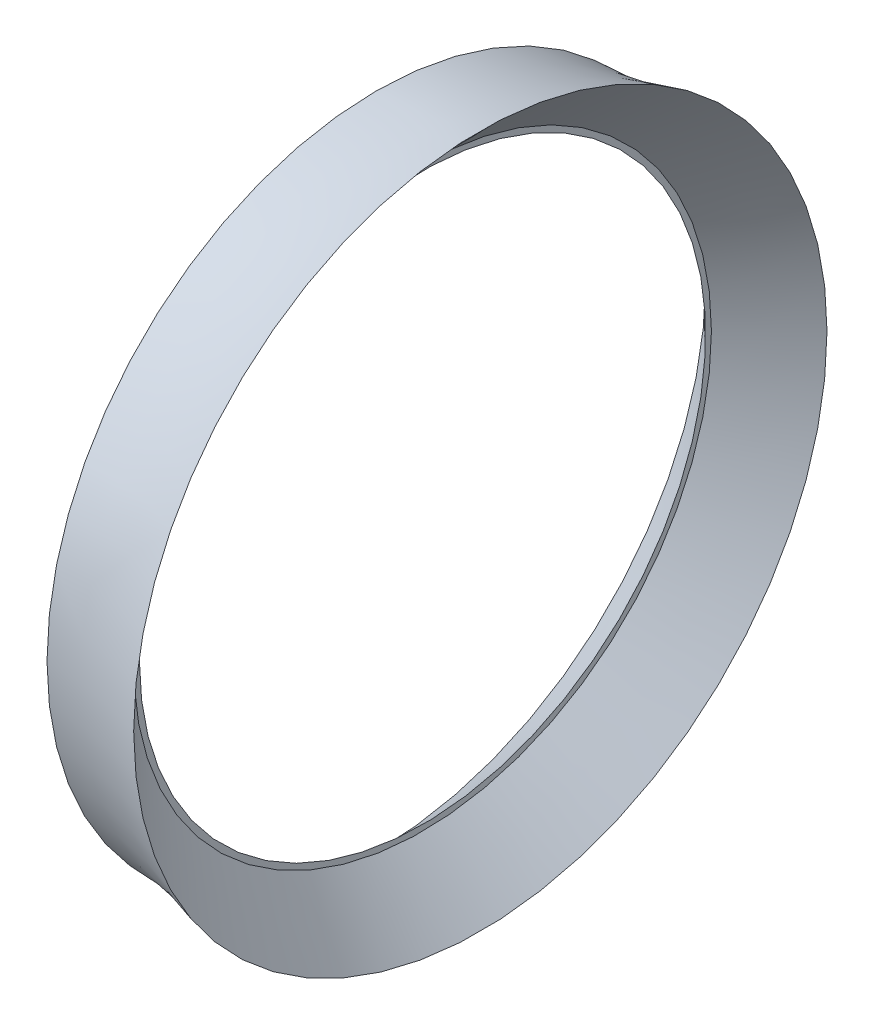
ISO-10303-21;
HEADER;
FILE_DESCRIPTION(('STEP AP214'),'2;1');
FILE_NAME('part.step','',(''),(''),'','','');
FILE_SCHEMA(('AUTOMOTIVE_DESIGN { 1 0 10303 214 1 1 1 1 }'));
ENDSEC;
DATA;
#1=APPLICATION_CONTEXT('core data for automotive mechanical design processes');
#2=APPLICATION_PROTOCOL_DEFINITION('international standard','automotive_design',2000,#1);
#3=PRODUCT_CONTEXT('',#1,'mechanical');
#4=PRODUCT('Part','Part','',(#3));
#5=PRODUCT_RELATED_PRODUCT_CATEGORY('part','',(#4));
#6=PRODUCT_DEFINITION_FORMATION('','',#4);
#7=PRODUCT_DEFINITION_CONTEXT('part definition',#1,'design');
#8=PRODUCT_DEFINITION('design','',#6,#7);
#9=PRODUCT_DEFINITION_SHAPE('','',#8);
#10=(LENGTH_UNIT() NAMED_UNIT(*) SI_UNIT(.MILLI.,.METRE.));
#11=(NAMED_UNIT(*) PLANE_ANGLE_UNIT() SI_UNIT($,.RADIAN.));
#12=(NAMED_UNIT(*) SI_UNIT($,.STERADIAN.) SOLID_ANGLE_UNIT());
#13=UNCERTAINTY_MEASURE_WITH_UNIT(LENGTH_MEASURE(1.E-05),#10,'distance_accuracy_value','');
#14=(GEOMETRIC_REPRESENTATION_CONTEXT(3) GLOBAL_UNCERTAINTY_ASSIGNED_CONTEXT((#13)) GLOBAL_UNIT_ASSIGNED_CONTEXT((#10,
#11,#12)) REPRESENTATION_CONTEXT('',''));
#15=CARTESIAN_POINT('',(0.,0.,0.));
#16=DIRECTION('',(0.,0.,1.));
#17=DIRECTION('',(1.,0.,0.));
#18=AXIS2_PLACEMENT_3D('',#15,#16,#17);
#19=CARTESIAN_POINT('',(-81.9999999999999,85.5050358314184,1.11022302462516E-13));
#20=DIRECTION('',(1.,0.,0.));
#21=DIRECTION('',(0.,0.,-1.));
#22=AXIS2_PLACEMENT_3D('',#19,#20,#21);
#23=TOROIDAL_SURFACE('',#22,28.124999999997,13.8749999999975);
#24=CARTESIAN_POINT('',(-81.9999999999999,85.5050358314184,1.11022302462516E-13));
#25=DIRECTION('',(1.,0.,0.));
#26=DIRECTION('',(0.,0.,-1.));
#27=AXIS2_PLACEMENT_3D('',#24,#25,#26);
#28=CIRCLE('',#27,14.2499999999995);
#29=CARTESIAN_POINT('',(-81.9999999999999,85.5050358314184,14.2499999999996));
#30=VERTEX_POINT('',#29);
#31=EDGE_CURVE('E54',#30,#30,#28,.T.);
#32=ORIENTED_EDGE('',*,*,#31,.T.);
#33=EDGE_LOOP('',(#32));
#34=FACE_BOUND('',#33,.T.);
#35=CARTESIAN_POINT('',(-77.4999999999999,85.5050358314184,0.));
#36=DIRECTION('',(1.,0.,0.));
#37=DIRECTION('',(0.,0.,-1.));
#38=AXIS2_PLACEMENT_3D('',#35,#36,#37);
#39=CIRCLE('',#38,14.9999999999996);
#40=CARTESIAN_POINT('',(-77.4999999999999,85.5050358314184,-14.9999999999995));
#41=VERTEX_POINT('',#40);
#42=EDGE_CURVE('E10',#41,#41,#39,.T.);
#43=ORIENTED_EDGE('',*,*,#42,.F.);
#44=EDGE_LOOP('',(#43));
#45=FACE_BOUND('',#44,.T.);
#46=ADVANCED_FACE('F40',(#34,#45),#23,.F.);
#47=CARTESIAN_POINT('',(-79.9999999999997,85.5050358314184,0.));
#48=DIRECTION('',(1.,0.,0.));
#49=DIRECTION('',(0.,0.,-1.));
#50=AXIS2_PLACEMENT_3D('',#47,#48,#49);
#51=CONICAL_SURFACE('',#50,12.4999999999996,0.785398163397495);
#52=CARTESIAN_POINT('',(-79.9999999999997,85.5050358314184,0.));
#53=DIRECTION('',(1.,0.,0.));
#54=DIRECTION('',(0.,0.,-1.));
#55=AXIS2_PLACEMENT_3D('',#52,#53,#54);
#56=CIRCLE('',#55,12.4999999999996);
#57=CARTESIAN_POINT('',(-79.9999999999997,85.5050358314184,-12.4999999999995));
#58=VERTEX_POINT('',#57);
#59=EDGE_CURVE('E46',#58,#58,#56,.T.);
#60=CARTESIAN_POINT('',(-77.4999999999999,85.5050358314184,-14.9999999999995));
#61=CARTESIAN_POINT('',(-77.5260416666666,85.5050358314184,-14.9739583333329));
#62=CARTESIAN_POINT('',(-77.5520833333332,85.5050358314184,-14.9479166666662));
#63=CARTESIAN_POINT('',(-77.6041666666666,85.5050358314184,-14.8958333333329));
#64=CARTESIAN_POINT('',(-77.6302083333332,85.5050358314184,-14.8697916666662));
#65=CARTESIAN_POINT('',(-77.6822916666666,85.5050358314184,-14.8177083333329));
#66=CARTESIAN_POINT('',(-77.7083333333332,85.5050358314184,-14.7916666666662));
#67=CARTESIAN_POINT('',(-77.7604166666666,85.5050358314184,-14.7395833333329));
#68=CARTESIAN_POINT('',(-77.7864583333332,85.5050358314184,-14.7135416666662));
#69=CARTESIAN_POINT('',(-77.8385416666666,85.5050358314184,-14.6614583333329));
#70=CARTESIAN_POINT('',(-77.8645833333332,85.5050358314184,-14.6354166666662));
#71=CARTESIAN_POINT('',(-77.9166666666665,85.5050358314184,-14.5833333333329));
#72=CARTESIAN_POINT('',(-77.9427083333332,85.5050358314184,-14.5572916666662));
#73=CARTESIAN_POINT('',(-77.9947916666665,85.5050358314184,-14.5052083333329));
#74=CARTESIAN_POINT('',(-78.0208333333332,85.5050358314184,-14.4791666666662));
#75=CARTESIAN_POINT('',(-78.0729166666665,85.5050358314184,-14.4270833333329));
#76=CARTESIAN_POINT('',(-78.0989583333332,85.5050358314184,-14.4010416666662));
#77=CARTESIAN_POINT('',(-78.1510416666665,85.5050358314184,-14.3489583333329));
#78=CARTESIAN_POINT('',(-78.1770833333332,85.5050358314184,-14.3229166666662));
#79=CARTESIAN_POINT('',(-78.2291666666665,85.5050358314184,-14.2708333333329));
#80=CARTESIAN_POINT('',(-78.2552083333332,85.5050358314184,-14.2447916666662));
#81=CARTESIAN_POINT('',(-78.3072916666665,85.5050358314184,-14.1927083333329));
#82=CARTESIAN_POINT('',(-78.3333333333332,85.5050358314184,-14.1666666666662));
#83=CARTESIAN_POINT('',(-78.3854166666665,85.5050358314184,-14.1145833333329));
#84=CARTESIAN_POINT('',(-78.4114583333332,85.5050358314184,-14.0885416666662));
#85=CARTESIAN_POINT('',(-78.4635416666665,85.5050358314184,-14.0364583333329));
#86=CARTESIAN_POINT('',(-78.4895833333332,85.5050358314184,-14.0104166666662));
#87=CARTESIAN_POINT('',(-78.5416666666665,85.5050358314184,-13.9583333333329));
#88=CARTESIAN_POINT('',(-78.5677083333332,85.5050358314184,-13.9322916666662));
#89=CARTESIAN_POINT('',(-78.6197916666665,85.5050358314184,-13.8802083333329));
#90=CARTESIAN_POINT('',(-78.6458333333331,85.5050358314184,-13.8541666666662));
#91=CARTESIAN_POINT('',(-78.6979166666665,85.5050358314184,-13.8020833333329));
#92=CARTESIAN_POINT('',(-78.7239583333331,85.5050358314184,-13.7760416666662));
#93=CARTESIAN_POINT('',(-78.7760416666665,85.5050358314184,-13.7239583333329));
#94=CARTESIAN_POINT('',(-78.8020833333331,85.5050358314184,-13.6979166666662));
#95=CARTESIAN_POINT('',(-78.8541666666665,85.5050358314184,-13.6458333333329));
#96=CARTESIAN_POINT('',(-78.8802083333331,85.5050358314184,-13.6197916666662));
#97=CARTESIAN_POINT('',(-78.9322916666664,85.5050358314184,-13.5677083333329));
#98=CARTESIAN_POINT('',(-78.9583333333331,85.5050358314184,-13.5416666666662));
#99=CARTESIAN_POINT('',(-79.0104166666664,85.5050358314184,-13.4895833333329));
#100=CARTESIAN_POINT('',(-79.0364583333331,85.5050358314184,-13.4635416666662));
#101=CARTESIAN_POINT('',(-79.0885416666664,85.5050358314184,-13.4114583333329));
#102=CARTESIAN_POINT('',(-79.1145833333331,85.5050358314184,-13.3854166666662));
#103=CARTESIAN_POINT('',(-79.1666666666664,85.5050358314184,-13.3333333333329));
#104=CARTESIAN_POINT('',(-79.1927083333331,85.5050358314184,-13.3072916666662));
#105=CARTESIAN_POINT('',(-79.2447916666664,85.5050358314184,-13.2552083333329));
#106=CARTESIAN_POINT('',(-79.2708333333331,85.5050358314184,-13.2291666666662));
#107=CARTESIAN_POINT('',(-79.3229166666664,85.5050358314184,-13.1770833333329));
#108=CARTESIAN_POINT('',(-79.3489583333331,85.5050358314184,-13.1510416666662));
#109=CARTESIAN_POINT('',(-79.4010416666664,85.5050358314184,-13.0989583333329));
#110=CARTESIAN_POINT('',(-79.4270833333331,85.5050358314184,-13.0729166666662));
#111=CARTESIAN_POINT('',(-79.4791666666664,85.5050358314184,-13.0208333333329));
#112=CARTESIAN_POINT('',(-79.5052083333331,85.5050358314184,-12.9947916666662));
#113=CARTESIAN_POINT('',(-79.5572916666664,85.5050358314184,-12.9427083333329));
#114=CARTESIAN_POINT('',(-79.5833333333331,85.5050358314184,-12.9166666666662));
#115=CARTESIAN_POINT('',(-79.6354166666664,85.5050358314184,-12.8645833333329));
#116=CARTESIAN_POINT('',(-79.661458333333,85.5050358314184,-12.8385416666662));
#117=CARTESIAN_POINT('',(-79.7135416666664,85.5050358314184,-12.7864583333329));
#118=CARTESIAN_POINT('',(-79.739583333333,85.5050358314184,-12.7604166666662));
#119=CARTESIAN_POINT('',(-79.7916666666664,85.5050358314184,-12.7083333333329));
#120=CARTESIAN_POINT('',(-79.817708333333,85.5050358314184,-12.6822916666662));
#121=CARTESIAN_POINT('',(-79.8697916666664,85.5050358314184,-12.6302083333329));
#122=CARTESIAN_POINT('',(-79.895833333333,85.5050358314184,-12.6041666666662));
#123=CARTESIAN_POINT('',(-79.9479166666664,85.5050358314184,-12.5520833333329));
#124=CARTESIAN_POINT('',(-79.973958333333,85.5050358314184,-12.5260416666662));
#125=CARTESIAN_POINT('',(-79.9999999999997,85.5050358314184,-12.4999999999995));
#126=B_SPLINE_CURVE_WITH_KNOTS('',3,(#60,#61,#62,#63,#64,#65,#66,#67,#68,#69,#70,#71,#72,#73,
#74,#75,#76,#77,#78,#79,#80,#81,#82,#83,#84,#85,#86,#87,#88,#89,#90,#91,#92,#93,#94,#95,#96,#97,
#98,#99,#100,#101,#102,#103,#104,#105,#106,#107,#108,#109,#110,#111,#112,#113,#114,#115,#116,
#117,#118,#119,#120,#121,#122,#123,#124,#125),.UNSPECIFIED.,.F.,.F.,(4,2,2,2,2,2,2,2,2,2,2,2,2,
2,2,2,2,2,2,2,2,2,2,2,2,2,2,2,2,2,2,2,4),(0.,0.110485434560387,0.220970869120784,
0.331456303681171,0.441941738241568,0.552427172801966,0.662912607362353,0.77339804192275,
0.883883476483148,0.994368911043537,1.10485434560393,1.21533978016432,1.32582521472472,
1.43631064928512,1.5467960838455,1.6572815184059,1.7677669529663,1.87825238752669,
1.98873782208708,2.09922325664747,2.20970869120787,2.32019412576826,2.43067956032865,
2.54116499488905,2.65165042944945,2.76213586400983,2.87262129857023,2.98310673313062,
3.09359216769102,3.20407760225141,3.3145630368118,3.4250484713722,3.53553390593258),.UNSPECIFIED.);
#127=EDGE_CURVE('BSEAM70',#41,#58,#126,.T.);
#128=ORIENTED_EDGE('',*,*,#42,.T.);
#129=ORIENTED_EDGE('',*,*,#59,.F.);
#130=ORIENTED_EDGE('',*,*,#127,.T.);
#131=ORIENTED_EDGE('',*,*,#127,.F.);
#132=EDGE_LOOP('',(#128,#130,#129,#131));
#133=FACE_BOUND('',#132,.T.);
#134=ADVANCED_FACE('F70',(#133),#51,.F.);
#135=CARTESIAN_POINT('',(-79.9999999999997,98.005035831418,0.));
#136=DIRECTION('',(1.,0.,0.));
#137=DIRECTION('',(0.,0.,-1.));
#138=AXIS2_PLACEMENT_3D('',#135,#136,#137);
#139=PLANE('',#138);
#140=ORIENTED_EDGE('',*,*,#59,.T.);
#141=EDGE_LOOP('',(#140));
#142=FACE_BOUND('',#141,.T.);
#143=CARTESIAN_POINT('',(-79.9999999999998,85.5050358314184,1.66533453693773E-13));
#144=DIRECTION('',(1.,0.,0.));
#145=DIRECTION('',(0.,0.,-1.));
#146=AXIS2_PLACEMENT_3D('',#143,#144,#145);
#147=CIRCLE('',#146,12.2499999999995);
#148=CARTESIAN_POINT('',(-79.9999999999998,85.5050358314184,12.2499999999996));
#149=VERTEX_POINT('',#148);
#150=EDGE_CURVE('E50',#149,#149,#147,.T.);
#151=ORIENTED_EDGE('',*,*,#150,.F.);
#152=EDGE_LOOP('',(#151));
#153=FACE_BOUND('',#152,.T.);
#154=ADVANCED_FACE('F64',(#142,#153),#139,.T.);
#155=CARTESIAN_POINT('',(-81.9999999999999,85.5050358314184,1.11022302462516E-13));
#156=DIRECTION('',(-1.,0.,0.));
#157=DIRECTION('',(0.,0.,1.));
#158=AXIS2_PLACEMENT_3D('',#155,#156,#157);
#159=CONICAL_SURFACE('',#158,14.2499999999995,0.785398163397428);
#160=CARTESIAN_POINT('',(-79.9999999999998,85.5050358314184,12.2499999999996));
#161=CARTESIAN_POINT('',(-80.0208333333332,85.5050358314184,12.270833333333));
#162=CARTESIAN_POINT('',(-80.0416666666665,85.5050358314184,12.2916666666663));
#163=CARTESIAN_POINT('',(-80.0833333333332,85.5050358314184,12.333333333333));
#164=CARTESIAN_POINT('',(-80.1041666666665,85.5050358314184,12.3541666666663));
#165=CARTESIAN_POINT('',(-80.1458333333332,85.5050358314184,12.395833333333));
#166=CARTESIAN_POINT('',(-80.1666666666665,85.5050358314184,12.4166666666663));
#167=CARTESIAN_POINT('',(-80.2083333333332,85.5050358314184,12.458333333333));
#168=CARTESIAN_POINT('',(-80.2291666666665,85.5050358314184,12.4791666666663));
#169=CARTESIAN_POINT('',(-80.2708333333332,85.5050358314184,12.520833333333));
#170=CARTESIAN_POINT('',(-80.2916666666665,85.5050358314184,12.5416666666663));
#171=CARTESIAN_POINT('',(-80.3333333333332,85.5050358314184,12.583333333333));
#172=CARTESIAN_POINT('',(-80.3541666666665,85.5050358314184,12.6041666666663));
#173=CARTESIAN_POINT('',(-80.3958333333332,85.5050358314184,12.645833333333));
#174=CARTESIAN_POINT('',(-80.4166666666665,85.5050358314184,12.6666666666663));
#175=CARTESIAN_POINT('',(-80.4583333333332,85.5050358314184,12.708333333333));
#176=CARTESIAN_POINT('',(-80.4791666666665,85.5050358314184,12.7291666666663));
#177=CARTESIAN_POINT('',(-80.5208333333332,85.5050358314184,12.770833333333));
#178=CARTESIAN_POINT('',(-80.5416666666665,85.5050358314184,12.7916666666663));
#179=CARTESIAN_POINT('',(-80.5833333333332,85.5050358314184,12.8333333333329));
#180=CARTESIAN_POINT('',(-80.6041666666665,85.5050358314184,12.8541666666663));
#181=CARTESIAN_POINT('',(-80.6458333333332,85.5050358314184,12.8958333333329));
#182=CARTESIAN_POINT('',(-80.6666666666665,85.5050358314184,12.9166666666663));
#183=CARTESIAN_POINT('',(-80.7083333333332,85.5050358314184,12.9583333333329));
#184=CARTESIAN_POINT('',(-80.7291666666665,85.5050358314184,12.9791666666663));
#185=CARTESIAN_POINT('',(-80.7708333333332,85.5050358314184,13.0208333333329));
#186=CARTESIAN_POINT('',(-80.7916666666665,85.5050358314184,13.0416666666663));
#187=CARTESIAN_POINT('',(-80.8333333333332,85.5050358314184,13.0833333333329));
#188=CARTESIAN_POINT('',(-80.8541666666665,85.5050358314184,13.1041666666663));
#189=CARTESIAN_POINT('',(-80.8958333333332,85.5050358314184,13.1458333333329));
#190=CARTESIAN_POINT('',(-80.9166666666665,85.5050358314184,13.1666666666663));
#191=CARTESIAN_POINT('',(-80.9583333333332,85.5050358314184,13.2083333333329));
#192=CARTESIAN_POINT('',(-80.9791666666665,85.5050358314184,13.2291666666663));
#193=CARTESIAN_POINT('',(-81.0208333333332,85.5050358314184,13.2708333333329));
#194=CARTESIAN_POINT('',(-81.0416666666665,85.5050358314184,13.2916666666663));
#195=CARTESIAN_POINT('',(-81.0833333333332,85.5050358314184,13.3333333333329));
#196=CARTESIAN_POINT('',(-81.1041666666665,85.5050358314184,13.3541666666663));
#197=CARTESIAN_POINT('',(-81.1458333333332,85.5050358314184,13.3958333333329));
#198=CARTESIAN_POINT('',(-81.1666666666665,85.5050358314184,13.4166666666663));
#199=CARTESIAN_POINT('',(-81.2083333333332,85.5050358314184,13.4583333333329));
#200=CARTESIAN_POINT('',(-81.2291666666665,85.5050358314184,13.4791666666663));
#201=CARTESIAN_POINT('',(-81.2708333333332,85.5050358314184,13.5208333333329));
#202=CARTESIAN_POINT('',(-81.2916666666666,85.5050358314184,13.5416666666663));
#203=CARTESIAN_POINT('',(-81.3333333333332,85.5050358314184,13.5833333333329));
#204=CARTESIAN_POINT('',(-81.3541666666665,85.5050358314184,13.6041666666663));
#205=CARTESIAN_POINT('',(-81.3958333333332,85.5050358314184,13.6458333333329));
#206=CARTESIAN_POINT('',(-81.4166666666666,85.5050358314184,13.6666666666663));
#207=CARTESIAN_POINT('',(-81.4583333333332,85.5050358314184,13.7083333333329));
#208=CARTESIAN_POINT('',(-81.4791666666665,85.5050358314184,13.7291666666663));
#209=CARTESIAN_POINT('',(-81.5208333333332,85.5050358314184,13.7708333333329));
#210=CARTESIAN_POINT('',(-81.5416666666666,85.5050358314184,13.7916666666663));
#211=CARTESIAN_POINT('',(-81.5833333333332,85.5050358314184,13.8333333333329));
#212=CARTESIAN_POINT('',(-81.6041666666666,85.5050358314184,13.8541666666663));
#213=CARTESIAN_POINT('',(-81.6458333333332,85.5050358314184,13.8958333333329));
#214=CARTESIAN_POINT('',(-81.6666666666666,85.5050358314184,13.9166666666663));
#215=CARTESIAN_POINT('',(-81.7083333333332,85.5050358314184,13.9583333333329));
#216=CARTESIAN_POINT('',(-81.7291666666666,85.5050358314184,13.9791666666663));
#217=CARTESIAN_POINT('',(-81.7708333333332,85.5050358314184,14.0208333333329));
#218=CARTESIAN_POINT('',(-81.7916666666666,85.5050358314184,14.0416666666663));
#219=CARTESIAN_POINT('',(-81.8333333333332,85.5050358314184,14.0833333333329));
#220=CARTESIAN_POINT('',(-81.8541666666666,85.5050358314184,14.1041666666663));
#221=CARTESIAN_POINT('',(-81.8958333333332,85.5050358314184,14.1458333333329));
#222=CARTESIAN_POINT('',(-81.9166666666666,85.5050358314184,14.1666666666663));
#223=CARTESIAN_POINT('',(-81.9583333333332,85.5050358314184,14.2083333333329));
#224=CARTESIAN_POINT('',(-81.9791666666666,85.5050358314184,14.2291666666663));
#225=CARTESIAN_POINT('',(-81.9999999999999,85.5050358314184,14.2499999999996));
#226=B_SPLINE_CURVE_WITH_KNOTS('',3,(#160,#161,#162,#163,#164,#165,#166,#167,#168,#169,#170,
#171,#172,#173,#174,#175,#176,#177,#178,#179,#180,#181,#182,#183,#184,#185,#186,#187,#188,#189,
#190,#191,#192,#193,#194,#195,#196,#197,#198,#199,#200,#201,#202,#203,#204,#205,#206,#207,#208,
#209,#210,#211,#212,#213,#214,#215,#216,#217,#218,#219,#220,#221,#222,#223,#224,#225),
.UNSPECIFIED.,.F.,.F.,(4,2,2,2,2,2,2,2,2,2,2,2,2,2,2,2,2,2,2,2,2,2,2,2,2,2,2,2,2,2,2,2,4),(0.,
0.0883883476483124,0.176776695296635,0.265165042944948,0.353553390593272,0.441941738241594,
0.530330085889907,0.61871843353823,0.707106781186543,0.795495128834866,0.883883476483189,
0.972271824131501,1.06066017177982,1.14904851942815,1.23743686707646,1.32582521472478,
1.41421356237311,1.50260191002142,1.59099025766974,1.67937860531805,1.76776695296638,
1.8561553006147,1.94454364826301,2.03293199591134,2.12132034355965,2.20970869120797,
2.29809703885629,2.38648538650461,2.47487373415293,2.56326208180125,2.65165042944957,
2.74003877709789,2.82842712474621),.UNSPECIFIED.);
#227=EDGE_CURVE('BSEAM62',#149,#30,#226,.T.);
#228=ORIENTED_EDGE('',*,*,#150,.T.);
#229=ORIENTED_EDGE('',*,*,#31,.F.);
#230=ORIENTED_EDGE('',*,*,#227,.T.);
#231=ORIENTED_EDGE('',*,*,#227,.F.);
#232=EDGE_LOOP('',(#228,#230,#229,#231));
#233=FACE_BOUND('',#232,.T.);
#234=ADVANCED_FACE('F62',(#233),#159,.F.);
#235=CLOSED_SHELL('',(#46,#134,#154,#234));
#236=MANIFOLD_SOLID_BREP('B2',#235);
#237=ADVANCED_BREP_SHAPE_REPRESENTATION('',(#18,#236),#14);
#238=SHAPE_DEFINITION_REPRESENTATION(#9,#237);
ENDSEC;
END-ISO-10303-21;
